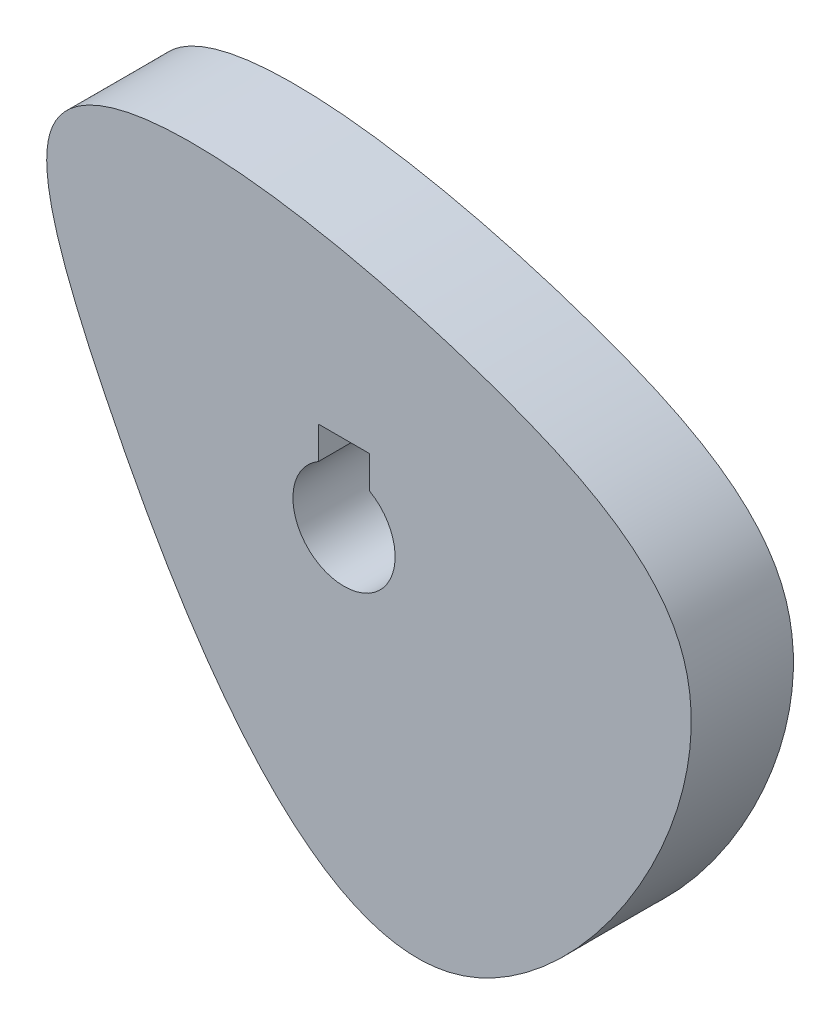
ISO-10303-21;
HEADER;
FILE_DESCRIPTION(('STEP AP214'),'2;1');
FILE_NAME('part.step','',(''),(''),'','','');
FILE_SCHEMA(('AUTOMOTIVE_DESIGN { 1 0 10303 214 1 1 1 1 }'));
ENDSEC;
DATA;
#1=APPLICATION_CONTEXT('core data for automotive mechanical design processes');
#2=APPLICATION_PROTOCOL_DEFINITION('international standard','automotive_design',2000,#1);
#3=PRODUCT_CONTEXT('',#1,'mechanical');
#4=PRODUCT('Part','Part','',(#3));
#5=PRODUCT_RELATED_PRODUCT_CATEGORY('part','',(#4));
#6=PRODUCT_DEFINITION_FORMATION('','',#4);
#7=PRODUCT_DEFINITION_CONTEXT('part definition',#1,'design');
#8=PRODUCT_DEFINITION('design','',#6,#7);
#9=PRODUCT_DEFINITION_SHAPE('','',#8);
#10=(LENGTH_UNIT() NAMED_UNIT(*) SI_UNIT(.MILLI.,.METRE.));
#11=(NAMED_UNIT(*) PLANE_ANGLE_UNIT() SI_UNIT($,.RADIAN.));
#12=(NAMED_UNIT(*) SI_UNIT($,.STERADIAN.) SOLID_ANGLE_UNIT());
#13=UNCERTAINTY_MEASURE_WITH_UNIT(LENGTH_MEASURE(1.E-05),#10,'distance_accuracy_value','');
#14=(GEOMETRIC_REPRESENTATION_CONTEXT(3) GLOBAL_UNCERTAINTY_ASSIGNED_CONTEXT((#13)) GLOBAL_UNIT_ASSIGNED_CONTEXT((#10,
#11,#12)) REPRESENTATION_CONTEXT('',''));
#15=CARTESIAN_POINT('',(0.,0.,0.));
#16=DIRECTION('',(0.,0.,1.));
#17=DIRECTION('',(1.,0.,0.));
#18=AXIS2_PLACEMENT_3D('',#15,#16,#17);
#19=CARTESIAN_POINT('',(-47.2344324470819,0.,10.));
#20=CARTESIAN_POINT('',(-30.2771757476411,-35.1402960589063,10.));
#21=CARTESIAN_POINT('',(16.581280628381,-106.488328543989,10.));
#22=CARTESIAN_POINT('',(89.543775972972,9.16363206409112,10.));
#23=CARTESIAN_POINT('',(20.2506887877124,46.6543585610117,10.));
#24=CARTESIAN_POINT('',(-73.2094830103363,61.3028974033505,10.));
#25=CARTESIAN_POINT('',(-54.3136450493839,14.6701575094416,10.));
#26=CARTESIAN_POINT('',(-47.2344324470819,0.,10.));
#27=B_SPLINE_CURVE_WITH_KNOTS('',3,(#19,#20,#21,#22,#23,#24,#25,#26),.UNSPECIFIED.,.T.,.F.,(4,1,
1,1,1,4),(0.,0.265537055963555,0.516377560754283,0.641014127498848,0.889145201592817,1.),.UNSPECIFIED.);
#28=DIRECTION('',(0.,0.,-1.));
#29=VECTOR('',#28,1.);
#30=SURFACE_OF_LINEAR_EXTRUSION('',#27,#29);
#31=CARTESIAN_POINT('',(-47.2344324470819,0.,10.));
#32=VERTEX_POINT('',#31);
#33=EDGE_CURVE('E11',#32,#32,#27,.T.);
#34=ORIENTED_EDGE('',*,*,#33,.F.);
#35=EDGE_LOOP('',(#34));
#36=FACE_BOUND('',#35,.T.);
#37=CARTESIAN_POINT('',(-47.2344324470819,0.,-10.));
#38=CARTESIAN_POINT('',(-30.2771757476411,-35.1402960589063,-10.));
#39=CARTESIAN_POINT('',(16.581280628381,-106.488328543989,-10.));
#40=CARTESIAN_POINT('',(89.543775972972,9.16363206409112,-10.));
#41=CARTESIAN_POINT('',(20.2506887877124,46.6543585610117,-10.));
#42=CARTESIAN_POINT('',(-73.2094830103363,61.3028974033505,-10.));
#43=CARTESIAN_POINT('',(-54.3136450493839,14.6701575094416,-10.));
#44=CARTESIAN_POINT('',(-47.2344324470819,0.,-10.));
#45=B_SPLINE_CURVE_WITH_KNOTS('',3,(#37,#38,#39,#40,#41,#42,#43,#44),.UNSPECIFIED.,.T.,.F.,(4,1,
1,1,1,4),(0.,0.265537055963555,0.516377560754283,0.641014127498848,0.889145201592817,1.),.UNSPECIFIED.);
#46=CARTESIAN_POINT('',(-47.2344324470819,0.,-10.));
#47=VERTEX_POINT('',#46);
#48=EDGE_CURVE('E27',#47,#47,#45,.T.);
#49=ORIENTED_EDGE('',*,*,#48,.T.);
#50=EDGE_LOOP('',(#49));
#51=FACE_BOUND('',#50,.T.);
#52=ADVANCED_FACE('F17',(#36,#51),#30,.F.);
#53=CARTESIAN_POINT('',(67.5342825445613,6.61655243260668,10.));
#54=DIRECTION('',(0.,0.,1.));
#55=DIRECTION('',(1.,0.,0.));
#56=AXIS2_PLACEMENT_3D('',#53,#54,#55);
#57=PLANE('',#56);
#58=DIRECTION('',(-1.,0.,0.));
#59=VECTOR('',#58,1.);
#60=CARTESIAN_POINT('',(-131.319520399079,15.,10.));
#61=LINE('',#60,#59);
#62=CARTESIAN_POINT('',(5.,15.,10.));
#63=VERTEX_POINT('',#62);
#64=CARTESIAN_POINT('',(-5.,15.,10.));
#65=VERTEX_POINT('',#64);
#66=EDGE_CURVE('E34',#63,#65,#61,.T.);
#67=ORIENTED_EDGE('',*,*,#66,.F.);
#68=DIRECTION('',(0.,1.,0.));
#69=VECTOR('',#68,1.);
#70=CARTESIAN_POINT('',(5.,-8.67313175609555,10.));
#71=LINE('',#70,#69);
#72=CARTESIAN_POINT('',(5.,8.66025403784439,10.));
#73=VERTEX_POINT('',#72);
#74=EDGE_CURVE('E78',#73,#63,#71,.T.);
#75=ORIENTED_EDGE('',*,*,#74,.F.);
#76=CARTESIAN_POINT('',(0.,0.,10.));
#77=DIRECTION('',(0.,0.,-1.));
#78=DIRECTION('',(-1.,0.,0.));
#79=AXIS2_PLACEMENT_3D('',#76,#77,#78);
#80=CIRCLE('',#79,10.);
#81=CARTESIAN_POINT('',(-5.,8.66025403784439,10.));
#82=VERTEX_POINT('',#81);
#83=EDGE_CURVE('E62',#73,#82,#80,.T.);
#84=ORIENTED_EDGE('',*,*,#83,.T.);
#85=DIRECTION('',(0.,1.,0.));
#86=VECTOR('',#85,1.);
#87=CARTESIAN_POINT('',(-5.,-8.67313175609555,10.));
#88=LINE('',#87,#86);
#89=EDGE_CURVE('E71',#82,#65,#88,.T.);
#90=ORIENTED_EDGE('',*,*,#89,.T.);
#91=EDGE_LOOP('',(#67,#75,#84,#90));
#92=FACE_BOUND('',#91,.T.);
#93=ORIENTED_EDGE('',*,*,#33,.T.);
#94=EDGE_LOOP('',(#93));
#95=FACE_BOUND('',#94,.T.);
#96=ADVANCED_FACE('F75',(#92,#95),#57,.T.);
#97=CARTESIAN_POINT('',(67.5342825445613,6.61655243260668,-10.));
#98=DIRECTION('',(0.,0.,1.));
#99=DIRECTION('',(1.,0.,0.));
#100=AXIS2_PLACEMENT_3D('',#97,#98,#99);
#101=PLANE('',#100);
#102=DIRECTION('',(0.,1.,0.));
#103=VECTOR('',#102,1.);
#104=CARTESIAN_POINT('',(5.,-8.67313175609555,-10.));
#105=LINE('',#104,#103);
#106=CARTESIAN_POINT('',(5.,8.66025403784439,-10.));
#107=VERTEX_POINT('',#106);
#108=CARTESIAN_POINT('',(5.,15.,-10.));
#109=VERTEX_POINT('',#108);
#110=EDGE_CURVE('E89',#107,#109,#105,.T.);
#111=ORIENTED_EDGE('',*,*,#110,.T.);
#112=DIRECTION('',(-1.,0.,0.));
#113=VECTOR('',#112,1.);
#114=CARTESIAN_POINT('',(-131.319520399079,15.,-10.));
#115=LINE('',#114,#113);
#116=CARTESIAN_POINT('',(-5.,15.,-10.));
#117=VERTEX_POINT('',#116);
#118=EDGE_CURVE('E80',#109,#117,#115,.T.);
#119=ORIENTED_EDGE('',*,*,#118,.T.);
#120=DIRECTION('',(0.,1.,0.));
#121=VECTOR('',#120,1.);
#122=CARTESIAN_POINT('',(-5.,-8.67313175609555,-10.));
#123=LINE('',#122,#121);
#124=CARTESIAN_POINT('',(-5.,8.66025403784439,-10.));
#125=VERTEX_POINT('',#124);
#126=EDGE_CURVE('E86',#125,#117,#123,.T.);
#127=ORIENTED_EDGE('',*,*,#126,.F.);
#128=CARTESIAN_POINT('',(0.,0.,-10.));
#129=DIRECTION('',(0.,0.,-1.));
#130=DIRECTION('',(-1.,0.,0.));
#131=AXIS2_PLACEMENT_3D('',#128,#129,#130);
#132=CIRCLE('',#131,10.);
#133=EDGE_CURVE('E65',#107,#125,#132,.T.);
#134=ORIENTED_EDGE('',*,*,#133,.F.);
#135=EDGE_LOOP('',(#111,#119,#127,#134));
#136=FACE_BOUND('',#135,.T.);
#137=ORIENTED_EDGE('',*,*,#48,.F.);
#138=EDGE_LOOP('',(#137));
#139=FACE_BOUND('',#138,.T.);
#140=ADVANCED_FACE('F104',(#136,#139),#101,.F.);
#141=CARTESIAN_POINT('',(-131.319520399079,15.,-10.));
#142=DIRECTION('',(0.,1.,0.));
#143=DIRECTION('',(0.,0.,1.));
#144=AXIS2_PLACEMENT_3D('',#141,#142,#143);
#145=PLANE('',#144);
#146=ORIENTED_EDGE('',*,*,#66,.T.);
#147=DIRECTION('',(0.,0.,1.));
#148=VECTOR('',#147,1.);
#149=CARTESIAN_POINT('',(-5.,15.,-10.));
#150=LINE('',#149,#148);
#151=EDGE_CURVE('E68',#117,#65,#150,.T.);
#152=ORIENTED_EDGE('',*,*,#151,.F.);
#153=ORIENTED_EDGE('',*,*,#118,.F.);
#154=DIRECTION('',(0.,0.,1.));
#155=VECTOR('',#154,1.);
#156=CARTESIAN_POINT('',(5.,15.,-10.));
#157=LINE('',#156,#155);
#158=EDGE_CURVE('E92',#109,#63,#157,.T.);
#159=ORIENTED_EDGE('',*,*,#158,.T.);
#160=EDGE_LOOP('',(#146,#152,#153,#159));
#161=FACE_BOUND('',#160,.T.);
#162=ADVANCED_FACE('F106',(#161),#145,.F.);
#163=CARTESIAN_POINT('',(5.,-8.67313175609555,-10.));
#164=DIRECTION('',(1.,0.,0.));
#165=DIRECTION('',(0.,0.,-1.));
#166=AXIS2_PLACEMENT_3D('',#163,#164,#165);
#167=PLANE('',#166);
#168=ORIENTED_EDGE('',*,*,#74,.T.);
#169=ORIENTED_EDGE('',*,*,#158,.F.);
#170=ORIENTED_EDGE('',*,*,#110,.F.);
#171=DIRECTION('',(0.,0.,1.));
#172=VECTOR('',#171,1.);
#173=CARTESIAN_POINT('',(5.,8.66025403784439,-10.));
#174=LINE('',#173,#172);
#175=EDGE_CURVE('E67',#107,#73,#174,.T.);
#176=ORIENTED_EDGE('',*,*,#175,.T.);
#177=EDGE_LOOP('',(#168,#169,#170,#176));
#178=FACE_BOUND('',#177,.T.);
#179=ADVANCED_FACE('F115',(#178),#167,.F.);
#180=CARTESIAN_POINT('',(0.,0.,-10.));
#181=DIRECTION('',(0.,0.,1.));
#182=DIRECTION('',(1.,0.,0.));
#183=AXIS2_PLACEMENT_3D('',#180,#181,#182);
#184=CYLINDRICAL_SURFACE('',#183,10.);
#185=ORIENTED_EDGE('',*,*,#83,.F.);
#186=ORIENTED_EDGE('',*,*,#175,.F.);
#187=ORIENTED_EDGE('',*,*,#133,.T.);
#188=DIRECTION('',(0.,0.,1.));
#189=VECTOR('',#188,1.);
#190=CARTESIAN_POINT('',(-5.,8.66025403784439,-10.));
#191=LINE('',#190,#189);
#192=EDGE_CURVE('E42',#125,#82,#191,.T.);
#193=ORIENTED_EDGE('',*,*,#192,.T.);
#194=EDGE_LOOP('',(#185,#186,#187,#193));
#195=FACE_BOUND('',#194,.T.);
#196=ADVANCED_FACE('F60',(#195),#184,.F.);
#197=CARTESIAN_POINT('',(-5.,-8.67313175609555,-10.));
#198=DIRECTION('',(1.,0.,0.));
#199=DIRECTION('',(0.,0.,-1.));
#200=AXIS2_PLACEMENT_3D('',#197,#198,#199);
#201=PLANE('',#200);
#202=ORIENTED_EDGE('',*,*,#89,.F.);
#203=ORIENTED_EDGE('',*,*,#192,.F.);
#204=ORIENTED_EDGE('',*,*,#126,.T.);
#205=ORIENTED_EDGE('',*,*,#151,.T.);
#206=EDGE_LOOP('',(#202,#203,#204,#205));
#207=FACE_BOUND('',#206,.T.);
#208=ADVANCED_FACE('F72',(#207),#201,.T.);
#209=CLOSED_SHELL('',(#52,#96,#140,#162,#179,#196,#208));
#210=MANIFOLD_SOLID_BREP('B1',#209);
#211=ADVANCED_BREP_SHAPE_REPRESENTATION('',(#18,#210),#14);
#212=SHAPE_DEFINITION_REPRESENTATION(#9,#211);
ENDSEC;
END-ISO-10303-21;
